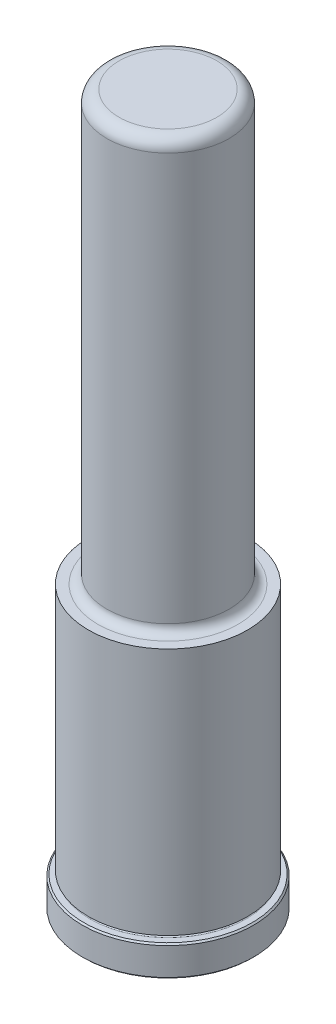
from build123d import *

# Parameters (mm, degrees)
CHAMFER1_SIZE = 0.381
FILLET7_R     = 3.175


with BuildPart() as part:
    # Sketch1 → Revolve1 (revolve)
    with BuildSketch(Plane(origin=(0, 0, 0), x_dir=(0, 0, -1), z_dir=(1, 0, 0)), mode=Mode.PRIVATE) as revolve1_sk:
        with BuildLine():
            Line((0, 0), (22.225, 0))
            Line((22.225, 0), (22.225, 7.9248))
            Line((22.225, 7.9248), (20.2438, 7.9248))
            ThreePointArc((20.2438, 7.9248), (19.8628, 8.3058), (20.2438, 8.6868))
            Line((20.2438, 8.6868), (20.6502, 8.6868))
            Line((20.6502, 8.6868), (20.6502, 73.025))
            Line((20.6502, 73.025), (18.1483, 73.025))
            ThreePointArc((18.1483, 73.025), (16.531853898, 73.694553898), (15.8623, 75.311))
            Line((15.8623, 75.311), (15.8623, 184.15))
            Line((15.8623, 184.15), (0, 184.15))
            Line((0, 184.15), (0, 0))
        make_face()
    revolve(revolve1_sk.sketch.rotate(Axis((0, 0, 0), (0, -1, 0)), 180), axis=Axis((0, 0, 0), (0, -1, 0)))

    # Chamfer1
    chamfer1_edges = [part.edges().sort_by_distance(p)[0] for p in [
        (0, 7.9248, -22.225),
        (0, 0, -22.225),
    ]]
    chamfer(chamfer1_edges, length=CHAMFER1_SIZE)

    # Fillet7
    fillet7_edges = [part.edges().sort_by_distance(p)[0] for p in [
        (0, 184.15, -15.8623),
    ]]
    fillet(fillet7_edges, radius=FILLET7_R)


solid = part.part
